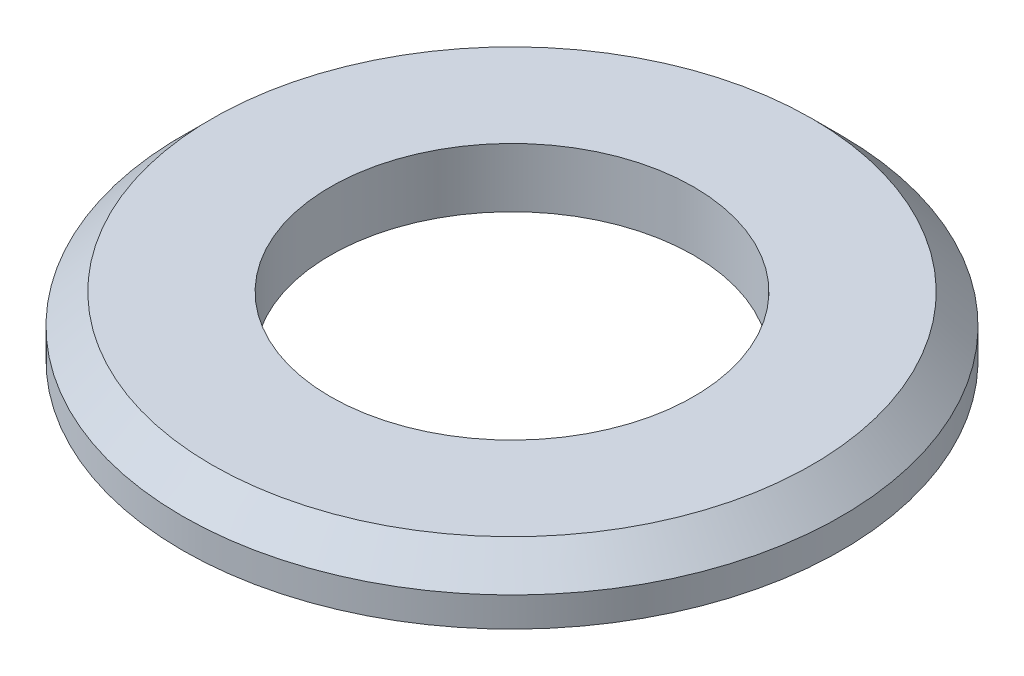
ISO-10303-21;
HEADER;
FILE_DESCRIPTION(('STEP AP214'),'2;1');
FILE_NAME('part.step','',(''),(''),'','','');
FILE_SCHEMA(('AUTOMOTIVE_DESIGN { 1 0 10303 214 1 1 1 1 }'));
ENDSEC;
DATA;
#1=APPLICATION_CONTEXT('core data for automotive mechanical design processes');
#2=APPLICATION_PROTOCOL_DEFINITION('international standard','automotive_design',2000,#1);
#3=PRODUCT_CONTEXT('',#1,'mechanical');
#4=PRODUCT('Part','Part','',(#3));
#5=PRODUCT_RELATED_PRODUCT_CATEGORY('part','',(#4));
#6=PRODUCT_DEFINITION_FORMATION('','',#4);
#7=PRODUCT_DEFINITION_CONTEXT('part definition',#1,'design');
#8=PRODUCT_DEFINITION('design','',#6,#7);
#9=PRODUCT_DEFINITION_SHAPE('','',#8);
#10=(LENGTH_UNIT() NAMED_UNIT(*) SI_UNIT(.MILLI.,.METRE.));
#11=(NAMED_UNIT(*) PLANE_ANGLE_UNIT() SI_UNIT($,.RADIAN.));
#12=(NAMED_UNIT(*) SI_UNIT($,.STERADIAN.) SOLID_ANGLE_UNIT());
#13=UNCERTAINTY_MEASURE_WITH_UNIT(LENGTH_MEASURE(1.E-05),#10,'distance_accuracy_value','');
#14=(GEOMETRIC_REPRESENTATION_CONTEXT(3) GLOBAL_UNCERTAINTY_ASSIGNED_CONTEXT((#13)) GLOBAL_UNIT_ASSIGNED_CONTEXT((#10,
#11,#12)) REPRESENTATION_CONTEXT('',''));
#15=CARTESIAN_POINT('',(0.,0.,0.));
#16=DIRECTION('',(0.,0.,1.));
#17=DIRECTION('',(1.,0.,0.));
#18=AXIS2_PLACEMENT_3D('',#15,#16,#17);
#19=CARTESIAN_POINT('',(0.,7.,0.));
#20=DIRECTION('',(0.,1.,0.));
#21=DIRECTION('',(0.,0.,1.));
#22=AXIS2_PLACEMENT_3D('',#19,#20,#21);
#23=PLANE('',#22);
#24=CARTESIAN_POINT('',(0.,7.,0.));
#25=DIRECTION('',(0.,1.,0.));
#26=DIRECTION('',(0.,0.,1.));
#27=AXIS2_PLACEMENT_3D('',#24,#25,#26);
#28=CIRCLE('',#27,35.5);
#29=CARTESIAN_POINT('',(0.,7.,-35.5));
#30=VERTEX_POINT('',#29);
#31=EDGE_CURVE('E35',#30,#30,#28,.T.);
#32=ORIENTED_EDGE('',*,*,#31,.T.);
#33=EDGE_LOOP('',(#32));
#34=FACE_BOUND('',#33,.T.);
#35=CARTESIAN_POINT('',(0.,7.,0.));
#36=DIRECTION('',(0.,1.,0.));
#37=DIRECTION('',(0.,0.,1.));
#38=AXIS2_PLACEMENT_3D('',#35,#36,#37);
#39=CIRCLE('',#38,21.5);
#40=CARTESIAN_POINT('',(0.,7.,21.5));
#41=VERTEX_POINT('',#40);
#42=EDGE_CURVE('E43',#41,#41,#39,.T.);
#43=ORIENTED_EDGE('',*,*,#42,.F.);
#44=EDGE_LOOP('',(#43));
#45=FACE_BOUND('',#44,.T.);
#46=ADVANCED_FACE('F28',(#34,#45),#23,.T.);
#47=CARTESIAN_POINT('',(0.,0.,0.));
#48=DIRECTION('',(0.,1.,0.));
#49=DIRECTION('',(0.,0.,1.));
#50=AXIS2_PLACEMENT_3D('',#47,#48,#49);
#51=PLANE('',#50);
#52=CARTESIAN_POINT('',(0.,0.,0.));
#53=DIRECTION('',(0.,1.,0.));
#54=DIRECTION('',(0.,0.,1.));
#55=AXIS2_PLACEMENT_3D('',#52,#53,#54);
#56=CIRCLE('',#55,39.);
#57=CARTESIAN_POINT('',(0.,0.,39.));
#58=VERTEX_POINT('',#57);
#59=EDGE_CURVE('E39',#58,#58,#56,.T.);
#60=ORIENTED_EDGE('',*,*,#59,.F.);
#61=EDGE_LOOP('',(#60));
#62=FACE_BOUND('',#61,.T.);
#63=CARTESIAN_POINT('',(0.,0.,0.));
#64=DIRECTION('',(0.,1.,0.));
#65=DIRECTION('',(0.,0.,1.));
#66=AXIS2_PLACEMENT_3D('',#63,#64,#65);
#67=CIRCLE('',#66,21.5);
#68=CARTESIAN_POINT('',(0.,0.,21.5));
#69=VERTEX_POINT('',#68);
#70=EDGE_CURVE('E48',#69,#69,#67,.T.);
#71=ORIENTED_EDGE('',*,*,#70,.T.);
#72=EDGE_LOOP('',(#71));
#73=FACE_BOUND('',#72,.T.);
#74=ADVANCED_FACE('F52',(#62,#73),#51,.F.);
#75=CARTESIAN_POINT('',(0.,7.,0.));
#76=DIRECTION('',(0.,-1.,0.));
#77=DIRECTION('',(0.,0.,-1.));
#78=AXIS2_PLACEMENT_3D('',#75,#76,#77);
#79=CYLINDRICAL_SURFACE('',#78,39.);
#80=CARTESIAN_POINT('',(0.,3.49999999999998,0.));
#81=DIRECTION('',(0.,1.,0.));
#82=DIRECTION('',(0.,0.,1.));
#83=AXIS2_PLACEMENT_3D('',#80,#81,#82);
#84=CIRCLE('',#83,39.);
#85=CARTESIAN_POINT('',(0.,3.49999999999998,-39.));
#86=VERTEX_POINT('',#85);
#87=EDGE_CURVE('E10',#86,#86,#84,.F.);
#88=ORIENTED_EDGE('',*,*,#87,.T.);
#89=EDGE_LOOP('',(#88));
#90=FACE_BOUND('',#89,.T.);
#91=ORIENTED_EDGE('',*,*,#59,.T.);
#92=EDGE_LOOP('',(#91));
#93=FACE_BOUND('',#92,.T.);
#94=ADVANCED_FACE('F30',(#90,#93),#79,.T.);
#95=CARTESIAN_POINT('',(0.,7.,0.));
#96=DIRECTION('',(0.,-1.,0.));
#97=DIRECTION('',(0.,0.,-1.));
#98=AXIS2_PLACEMENT_3D('',#95,#96,#97);
#99=CYLINDRICAL_SURFACE('',#98,21.5);
#100=ORIENTED_EDGE('',*,*,#42,.T.);
#101=EDGE_LOOP('',(#100));
#102=FACE_BOUND('',#101,.T.);
#103=ORIENTED_EDGE('',*,*,#70,.F.);
#104=EDGE_LOOP('',(#103));
#105=FACE_BOUND('',#104,.T.);
#106=ADVANCED_FACE('F54',(#102,#105),#99,.F.);
#107=CARTESIAN_POINT('',(0.,7.,0.));
#108=DIRECTION('',(0.,-1.,0.));
#109=DIRECTION('',(0.,0.,-1.));
#110=AXIS2_PLACEMENT_3D('',#107,#108,#109);
#111=CONICAL_SURFACE('',#110,35.5,0.785398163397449);
#112=CARTESIAN_POINT('',(0.,3.49999999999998,-39.));
#113=CARTESIAN_POINT('',(0.,3.53645833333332,-38.9635416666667));
#114=CARTESIAN_POINT('',(0.,3.57291666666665,-38.9270833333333));
#115=CARTESIAN_POINT('',(0.,3.64583333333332,-38.8541666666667));
#116=CARTESIAN_POINT('',(0.,3.68229166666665,-38.8177083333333));
#117=CARTESIAN_POINT('',(0.,3.75520833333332,-38.7447916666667));
#118=CARTESIAN_POINT('',(0.,3.79166666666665,-38.7083333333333));
#119=CARTESIAN_POINT('',(0.,3.86458333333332,-38.6354166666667));
#120=CARTESIAN_POINT('',(0.,3.90104166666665,-38.5989583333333));
#121=CARTESIAN_POINT('',(0.,3.97395833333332,-38.5260416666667));
#122=CARTESIAN_POINT('',(0.,4.01041666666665,-38.4895833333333));
#123=CARTESIAN_POINT('',(0.,4.08333333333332,-38.4166666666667));
#124=CARTESIAN_POINT('',(0.,4.11979166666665,-38.3802083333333));
#125=CARTESIAN_POINT('',(0.,4.19270833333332,-38.3072916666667));
#126=CARTESIAN_POINT('',(0.,4.22916666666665,-38.2708333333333));
#127=CARTESIAN_POINT('',(0.,4.30208333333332,-38.1979166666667));
#128=CARTESIAN_POINT('',(0.,4.33854166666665,-38.1614583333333));
#129=CARTESIAN_POINT('',(0.,4.41145833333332,-38.0885416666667));
#130=CARTESIAN_POINT('',(0.,4.44791666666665,-38.0520833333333));
#131=CARTESIAN_POINT('',(0.,4.52083333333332,-37.9791666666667));
#132=CARTESIAN_POINT('',(0.,4.55729166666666,-37.9427083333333));
#133=CARTESIAN_POINT('',(0.,4.63020833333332,-37.8697916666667));
#134=CARTESIAN_POINT('',(0.,4.66666666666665,-37.8333333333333));
#135=CARTESIAN_POINT('',(0.,4.73958333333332,-37.7604166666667));
#136=CARTESIAN_POINT('',(0.,4.77604166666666,-37.7239583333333));
#137=CARTESIAN_POINT('',(0.,4.84895833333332,-37.6510416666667));
#138=CARTESIAN_POINT('',(0.,4.88541666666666,-37.6145833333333));
#139=CARTESIAN_POINT('',(0.,4.95833333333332,-37.5416666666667));
#140=CARTESIAN_POINT('',(0.,4.99479166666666,-37.5052083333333));
#141=CARTESIAN_POINT('',(0.,5.06770833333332,-37.4322916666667));
#142=CARTESIAN_POINT('',(0.,5.10416666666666,-37.3958333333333));
#143=CARTESIAN_POINT('',(0.,5.17708333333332,-37.3229166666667));
#144=CARTESIAN_POINT('',(0.,5.21354166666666,-37.2864583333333));
#145=CARTESIAN_POINT('',(0.,5.28645833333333,-37.2135416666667));
#146=CARTESIAN_POINT('',(0.,5.32291666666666,-37.1770833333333));
#147=CARTESIAN_POINT('',(0.,5.39583333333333,-37.1041666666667));
#148=CARTESIAN_POINT('',(0.,5.43229166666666,-37.0677083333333));
#149=CARTESIAN_POINT('',(0.,5.50520833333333,-36.9947916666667));
#150=CARTESIAN_POINT('',(0.,5.54166666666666,-36.9583333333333));
#151=CARTESIAN_POINT('',(0.,5.61458333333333,-36.8854166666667));
#152=CARTESIAN_POINT('',(0.,5.65104166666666,-36.8489583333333));
#153=CARTESIAN_POINT('',(0.,5.72395833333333,-36.7760416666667));
#154=CARTESIAN_POINT('',(0.,5.76041666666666,-36.7395833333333));
#155=CARTESIAN_POINT('',(0.,5.83333333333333,-36.6666666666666));
#156=CARTESIAN_POINT('',(0.,5.86979166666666,-36.6302083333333));
#157=CARTESIAN_POINT('',(0.,5.94270833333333,-36.5572916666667));
#158=CARTESIAN_POINT('',(0.,5.97916666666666,-36.5208333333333));
#159=CARTESIAN_POINT('',(0.,6.05208333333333,-36.4479166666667));
#160=CARTESIAN_POINT('',(0.,6.08854166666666,-36.4114583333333));
#161=CARTESIAN_POINT('',(0.,6.16145833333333,-36.3385416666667));
#162=CARTESIAN_POINT('',(0.,6.19791666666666,-36.3020833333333));
#163=CARTESIAN_POINT('',(0.,6.27083333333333,-36.2291666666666));
#164=CARTESIAN_POINT('',(0.,6.30729166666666,-36.1927083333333));
#165=CARTESIAN_POINT('',(0.,6.38020833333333,-36.1197916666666));
#166=CARTESIAN_POINT('',(0.,6.41666666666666,-36.0833333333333));
#167=CARTESIAN_POINT('',(0.,6.48958333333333,-36.0104166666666));
#168=CARTESIAN_POINT('',(0.,6.52604166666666,-35.9739583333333));
#169=CARTESIAN_POINT('',(0.,6.59895833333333,-35.9010416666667));
#170=CARTESIAN_POINT('',(0.,6.63541666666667,-35.8645833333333));
#171=CARTESIAN_POINT('',(0.,6.70833333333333,-35.7916666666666));
#172=CARTESIAN_POINT('',(0.,6.74479166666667,-35.7552083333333));
#173=CARTESIAN_POINT('',(0.,6.81770833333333,-35.6822916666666));
#174=CARTESIAN_POINT('',(0.,6.85416666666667,-35.6458333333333));
#175=CARTESIAN_POINT('',(0.,6.92708333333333,-35.5729166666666));
#176=CARTESIAN_POINT('',(0.,6.96354166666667,-35.5364583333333));
#177=CARTESIAN_POINT('',(0.,7.,-35.5));
#178=B_SPLINE_CURVE_WITH_KNOTS('',3,(#112,#113,#114,#115,#116,#117,#118,#119,#120,#121,#122,
#123,#124,#125,#126,#127,#128,#129,#130,#131,#132,#133,#134,#135,#136,#137,#138,#139,#140,#141,
#142,#143,#144,#145,#146,#147,#148,#149,#150,#151,#152,#153,#154,#155,#156,#157,#158,#159,#160,
#161,#162,#163,#164,#165,#166,#167,#168,#169,#170,#171,#172,#173,#174,#175,#176,#177),
.UNSPECIFIED.,.F.,.F.,(4,2,2,2,2,2,2,2,2,2,2,2,2,2,2,2,2,2,2,2,2,2,2,2,2,2,2,2,2,2,2,2,4),(0.,
0.154679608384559,0.309359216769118,0.464038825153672,0.618718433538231,0.77339804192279,
0.928077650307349,1.08275725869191,1.23743686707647,1.39211647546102,1.54679608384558,
1.70147569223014,1.8561553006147,2.01083490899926,2.16551451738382,2.32019412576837,
2.47487373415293,2.62955334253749,2.78423295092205,2.93891255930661,3.09359216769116,
3.24827177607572,3.40295138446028,3.55763099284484,3.7123106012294,3.86699020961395,
4.02166981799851,4.17634942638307,4.33102903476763,4.48570864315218,4.64038825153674,
4.7950678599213,4.94974746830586),.UNSPECIFIED.);
#179=EDGE_CURVE('BSEAM56',#86,#30,#178,.T.);
#180=ORIENTED_EDGE('',*,*,#87,.F.);
#181=ORIENTED_EDGE('',*,*,#31,.F.);
#182=ORIENTED_EDGE('',*,*,#179,.T.);
#183=ORIENTED_EDGE('',*,*,#179,.F.);
#184=EDGE_LOOP('',(#180,#182,#181,#183));
#185=FACE_BOUND('',#184,.T.);
#186=ADVANCED_FACE('F56',(#185),#111,.T.);
#187=CLOSED_SHELL('',(#46,#74,#94,#106,#186));
#188=MANIFOLD_SOLID_BREP('B2',#187);
#189=ADVANCED_BREP_SHAPE_REPRESENTATION('',(#18,#188),#14);
#190=SHAPE_DEFINITION_REPRESENTATION(#9,#189);
ENDSEC;
END-ISO-10303-21;
